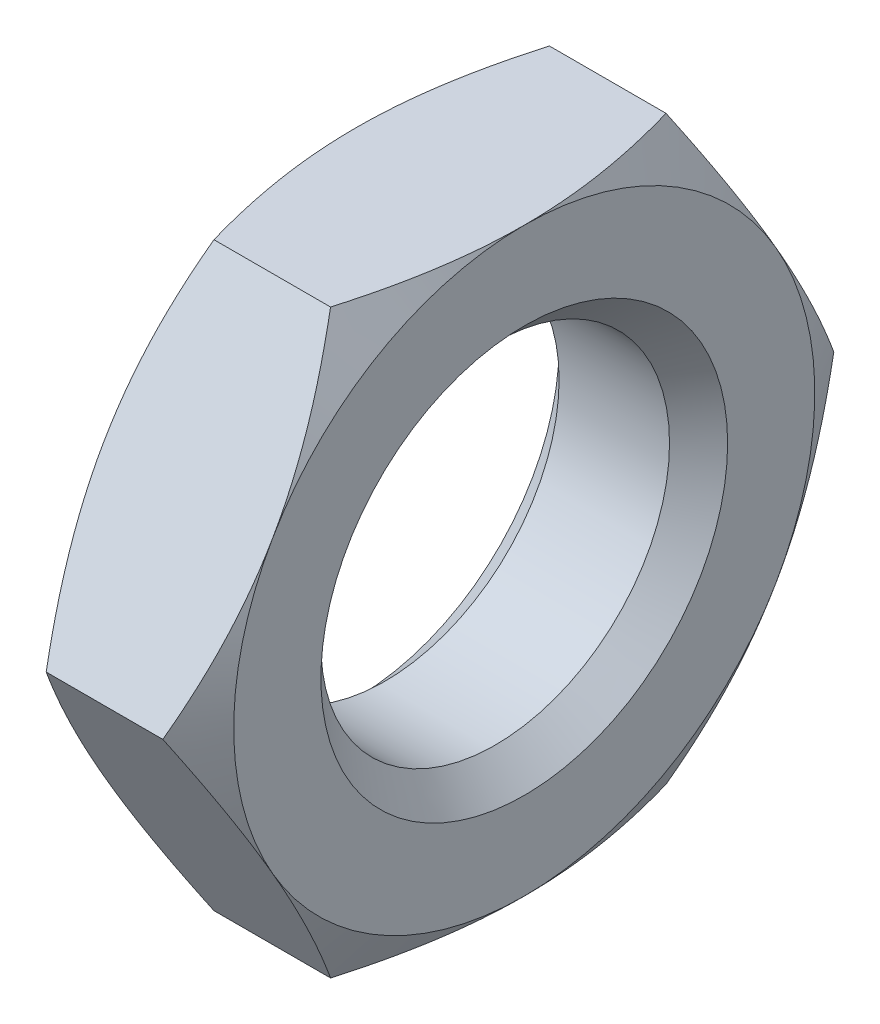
ISO-10303-21;
HEADER;
FILE_DESCRIPTION(('STEP AP214'),'2;1');
FILE_NAME('part.step','',(''),(''),'','','');
FILE_SCHEMA(('AUTOMOTIVE_DESIGN { 1 0 10303 214 1 1 1 1 }'));
ENDSEC;
DATA;
#1=APPLICATION_CONTEXT('core data for automotive mechanical design processes');
#2=APPLICATION_PROTOCOL_DEFINITION('international standard','automotive_design',2000,#1);
#3=PRODUCT_CONTEXT('',#1,'mechanical');
#4=PRODUCT('Part','Part','',(#3));
#5=PRODUCT_RELATED_PRODUCT_CATEGORY('part','',(#4));
#6=PRODUCT_DEFINITION_FORMATION('','',#4);
#7=PRODUCT_DEFINITION_CONTEXT('part definition',#1,'design');
#8=PRODUCT_DEFINITION('design','',#6,#7);
#9=PRODUCT_DEFINITION_SHAPE('','',#8);
#10=(LENGTH_UNIT() NAMED_UNIT(*) SI_UNIT(.MILLI.,.METRE.));
#11=(NAMED_UNIT(*) PLANE_ANGLE_UNIT() SI_UNIT($,.RADIAN.));
#12=(NAMED_UNIT(*) SI_UNIT($,.STERADIAN.) SOLID_ANGLE_UNIT());
#13=UNCERTAINTY_MEASURE_WITH_UNIT(LENGTH_MEASURE(1.E-05),#10,'distance_accuracy_value','');
#14=(GEOMETRIC_REPRESENTATION_CONTEXT(3) GLOBAL_UNCERTAINTY_ASSIGNED_CONTEXT((#13)) GLOBAL_UNIT_ASSIGNED_CONTEXT((#10,
#11,#12)) REPRESENTATION_CONTEXT('',''));
#15=CARTESIAN_POINT('',(0.,0.,0.));
#16=DIRECTION('',(0.,0.,1.));
#17=DIRECTION('',(1.,0.,0.));
#18=AXIS2_PLACEMENT_3D('',#15,#16,#17);
#19=CARTESIAN_POINT('',(2.9,5.,-2.88675134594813));
#20=DIRECTION('',(1.,0.,0.));
#21=DIRECTION('',(0.,0.,-1.));
#22=AXIS2_PLACEMENT_3D('',#19,#20,#21);
#23=PLANE('',#22);
#24=CARTESIAN_POINT('',(2.9,0.,0.));
#25=DIRECTION('',(1.,0.,0.));
#26=DIRECTION('',(0.,0.,-1.));
#27=AXIS2_PLACEMENT_3D('',#24,#25,#26);
#28=CIRCLE('',#27,3.5);
#29=CARTESIAN_POINT('',(2.9,0.,-3.5));
#30=VERTEX_POINT('',#29);
#31=EDGE_CURVE('E11',#30,#30,#28,.F.);
#32=ORIENTED_EDGE('',*,*,#31,.T.);
#33=EDGE_LOOP('',(#32));
#34=FACE_BOUND('',#33,.T.);
#35=CARTESIAN_POINT('',(2.9,0.,0.));
#36=DIRECTION('',(1.,0.,0.));
#37=DIRECTION('',(0.,0.,-1.));
#38=AXIS2_PLACEMENT_3D('',#35,#36,#37);
#39=CIRCLE('',#38,5.);
#40=CARTESIAN_POINT('',(2.9,-5.,0.));
#41=VERTEX_POINT('',#40);
#42=CARTESIAN_POINT('',(2.9,-2.5,-4.33012701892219));
#43=VERTEX_POINT('',#42);
#44=EDGE_CURVE('E142',#41,#43,#39,.T.);
#45=ORIENTED_EDGE('',*,*,#44,.T.);
#46=CARTESIAN_POINT('',(2.9,2.5,-4.33012701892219));
#47=VERTEX_POINT('',#46);
#48=EDGE_CURVE('E130',#43,#47,#39,.T.);
#49=ORIENTED_EDGE('',*,*,#48,.T.);
#50=CARTESIAN_POINT('',(2.9,5.,0.));
#51=VERTEX_POINT('',#50);
#52=EDGE_CURVE('E144',#47,#51,#39,.T.);
#53=ORIENTED_EDGE('',*,*,#52,.T.);
#54=CARTESIAN_POINT('',(2.9,2.5,4.33012701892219));
#55=VERTEX_POINT('',#54);
#56=EDGE_CURVE('E55',#51,#55,#39,.T.);
#57=ORIENTED_EDGE('',*,*,#56,.T.);
#58=CARTESIAN_POINT('',(2.9,-2.5,4.33012701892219));
#59=VERTEX_POINT('',#58);
#60=EDGE_CURVE('E63',#55,#59,#39,.T.);
#61=ORIENTED_EDGE('',*,*,#60,.T.);
#62=EDGE_CURVE('E166',#59,#41,#39,.T.);
#63=ORIENTED_EDGE('',*,*,#62,.T.);
#64=EDGE_LOOP('',(#45,#49,#53,#57,#61,#63));
#65=FACE_BOUND('',#64,.T.);
#66=ADVANCED_FACE('F39',(#34,#65),#23,.T.);
#67=CARTESIAN_POINT('',(0.,5.,-2.88675134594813));
#68=DIRECTION('',(1.,0.,0.));
#69=DIRECTION('',(0.,0.,-1.));
#70=AXIS2_PLACEMENT_3D('',#67,#68,#69);
#71=PLANE('',#70);
#72=CARTESIAN_POINT('',(0.,0.,0.));
#73=DIRECTION('',(1.,0.,0.));
#74=DIRECTION('',(0.,0.,-1.));
#75=AXIS2_PLACEMENT_3D('',#72,#73,#74);
#76=CIRCLE('',#75,3.5);
#77=CARTESIAN_POINT('',(0.,0.,-3.5));
#78=VERTEX_POINT('',#77);
#79=EDGE_CURVE('E164',#78,#78,#76,.T.);
#80=ORIENTED_EDGE('',*,*,#79,.T.);
#81=EDGE_LOOP('',(#80));
#82=FACE_BOUND('',#81,.T.);
#83=CARTESIAN_POINT('',(0.,0.,0.));
#84=DIRECTION('',(1.,0.,0.));
#85=DIRECTION('',(0.,0.,-1.));
#86=AXIS2_PLACEMENT_3D('',#83,#84,#85);
#87=CIRCLE('',#86,5.);
#88=CARTESIAN_POINT('',(0.,-2.5,-4.33012701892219));
#89=VERTEX_POINT('',#88);
#90=CARTESIAN_POINT('',(0.,2.5,-4.33012701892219));
#91=VERTEX_POINT('',#90);
#92=EDGE_CURVE('E173',#89,#91,#87,.T.);
#93=ORIENTED_EDGE('',*,*,#92,.F.);
#94=CARTESIAN_POINT('',(0.,-5.,0.));
#95=VERTEX_POINT('',#94);
#96=EDGE_CURVE('E317',#95,#89,#87,.T.);
#97=ORIENTED_EDGE('',*,*,#96,.F.);
#98=CARTESIAN_POINT('',(0.,-2.5,4.33012701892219));
#99=VERTEX_POINT('',#98);
#100=EDGE_CURVE('E320',#99,#95,#87,.T.);
#101=ORIENTED_EDGE('',*,*,#100,.F.);
#102=CARTESIAN_POINT('',(0.,2.5,4.33012701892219));
#103=VERTEX_POINT('',#102);
#104=EDGE_CURVE('E326',#103,#99,#87,.T.);
#105=ORIENTED_EDGE('',*,*,#104,.F.);
#106=CARTESIAN_POINT('',(0.,5.,0.));
#107=VERTEX_POINT('',#106);
#108=EDGE_CURVE('E178',#107,#103,#87,.T.);
#109=ORIENTED_EDGE('',*,*,#108,.F.);
#110=EDGE_CURVE('E174',#91,#107,#87,.T.);
#111=ORIENTED_EDGE('',*,*,#110,.F.);
#112=EDGE_LOOP('',(#93,#97,#101,#105,#109,#111));
#113=FACE_BOUND('',#112,.T.);
#114=ADVANCED_FACE('F318',(#82,#113),#71,.F.);
#115=CARTESIAN_POINT('',(2.9,0.,0.));
#116=DIRECTION('',(-1.,0.,0.));
#117=DIRECTION('',(0.,0.,1.));
#118=AXIS2_PLACEMENT_3D('',#115,#116,#117);
#119=CYLINDRICAL_SURFACE('',#118,3.);
#120=CARTESIAN_POINT('',(0.500000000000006,0.,0.));
#121=DIRECTION('',(1.,0.,0.));
#122=DIRECTION('',(0.,0.,-1.));
#123=AXIS2_PLACEMENT_3D('',#120,#121,#122);
#124=CIRCLE('',#123,3.);
#125=CARTESIAN_POINT('',(0.500000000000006,0.,-3.));
#126=VERTEX_POINT('',#125);
#127=EDGE_CURVE('E48',#126,#126,#124,.F.);
#128=ORIENTED_EDGE('',*,*,#127,.T.);
#129=EDGE_LOOP('',(#128));
#130=FACE_BOUND('',#129,.T.);
#131=CARTESIAN_POINT('',(2.4,0.,0.));
#132=DIRECTION('',(1.,0.,0.));
#133=DIRECTION('',(0.,0.,-1.));
#134=AXIS2_PLACEMENT_3D('',#131,#132,#133);
#135=CIRCLE('',#134,3.);
#136=CARTESIAN_POINT('',(2.4,0.,-3.));
#137=VERTEX_POINT('',#136);
#138=EDGE_CURVE('E386',#137,#137,#135,.T.);
#139=ORIENTED_EDGE('',*,*,#138,.T.);
#140=EDGE_LOOP('',(#139));
#141=FACE_BOUND('',#140,.T.);
#142=ADVANCED_FACE('F234',(#130,#141),#119,.F.);
#143=CARTESIAN_POINT('',(0.,0.,0.));
#144=DIRECTION('',(1.,0.,0.));
#145=DIRECTION('',(0.,0.,-1.));
#146=AXIS2_PLACEMENT_3D('',#143,#144,#145);
#147=CONICAL_SURFACE('',#146,5.,1.0471975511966);
#148=CARTESIAN_POINT('',(0.446648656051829,-5.0002,-2.88663587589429));
#149=CARTESIAN_POINT('',(0.373386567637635,-4.78046540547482,-3.01349970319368));
#150=CARTESIAN_POINT('',(0.306751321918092,-4.55885141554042,-3.14144859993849));
#151=CARTESIAN_POINT('',(0.190438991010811,-4.11178600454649,-3.39956193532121));
#152=CARTESIAN_POINT('',(0.140803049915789,-3.88632664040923,-3.52973095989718));
#153=CARTESIAN_POINT('',(0.0635510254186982,-3.43816769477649,-3.78847564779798));
#154=CARTESIAN_POINT('',(0.0354203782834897,-3.21553790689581,-3.91701101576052));
#155=CARTESIAN_POINT('',(0.0101949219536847,-2.88081009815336,-4.11026620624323));
#156=CARTESIAN_POINT('',(0.00461345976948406,-2.76915780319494,-4.17472868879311));
#157=CARTESIAN_POINT('',(-0.000797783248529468,-2.5457500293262,-4.30371322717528));
#158=CARTESIAN_POINT('',(-0.00062774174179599,-2.43399455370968,-4.36823528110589));
#159=CARTESIAN_POINT('',(0.0077536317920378,-2.12781576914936,-4.54500768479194));
#160=CARTESIAN_POINT('',(0.021829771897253,-1.93349391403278,-4.65719946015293));
#161=CARTESIAN_POINT('',(0.0664652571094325,-1.54613989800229,-4.88083840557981));
#162=CARTESIAN_POINT('',(0.0970398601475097,-1.35310909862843,-4.9922847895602));
#163=CARTESIAN_POINT('',(0.173468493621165,-0.964974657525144,-5.21637431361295));
#164=CARTESIAN_POINT('',(0.219646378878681,-0.769920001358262,-5.32898917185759));
#165=CARTESIAN_POINT('',(0.324451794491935,-0.38271965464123,-5.55253939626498));
#166=CARTESIAN_POINT('',(0.383054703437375,-0.190569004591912,-5.66347762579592));
#167=CARTESIAN_POINT('',(0.44664865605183,0.000200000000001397,-5.7736181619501));
#168=B_SPLINE_CURVE_WITH_KNOTS('',3,(#148,#149,#150,#151,#152,#153,#154,#155,#156,#157,#158,
#159,#160,#161,#162,#163,#164,#165,#166,#167),.UNSPECIFIED.,.F.,.F.,(4,2,2,2,2,2,2,2,2,4),(0.,
0.79255584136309,1.58701660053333,2.36181537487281,2.74884076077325,3.13585419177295,
3.80962362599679,4.48401723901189,5.17336882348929,5.86136694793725),.UNSPECIFIED.);
#169=CARTESIAN_POINT('',(0.446581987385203,0.,-5.77350269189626));
#170=VERTEX_POINT('',#169);
#171=EDGE_CURVE('E333',#89,#170,#168,.T.);
#172=ORIENTED_EDGE('',*,*,#171,.F.);
#173=ORIENTED_EDGE('',*,*,#92,.T.);
#174=CARTESIAN_POINT('',(0.44664865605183,-0.000199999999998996,-5.7736181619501));
#175=CARTESIAN_POINT('',(0.373386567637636,0.219534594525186,-5.64675433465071));
#176=CARTESIAN_POINT('',(0.306751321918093,0.441148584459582,-5.5188054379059));
#177=CARTESIAN_POINT('',(0.190438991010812,0.888213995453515,-5.26069210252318));
#178=CARTESIAN_POINT('',(0.14080304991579,1.11367335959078,-5.13052307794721));
#179=CARTESIAN_POINT('',(0.0635510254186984,1.56183230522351,-4.87177839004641));
#180=CARTESIAN_POINT('',(0.0354203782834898,1.78446209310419,-4.74324302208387));
#181=CARTESIAN_POINT('',(0.010194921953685,2.11918990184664,-4.54998783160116));
#182=CARTESIAN_POINT('',(0.00461345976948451,2.23084219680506,-4.48552534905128));
#183=CARTESIAN_POINT('',(-0.000797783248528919,2.4542499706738,-4.35654081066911));
#184=CARTESIAN_POINT('',(-0.000627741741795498,2.56600544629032,-4.2920187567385));
#185=CARTESIAN_POINT('',(0.00775363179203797,2.87218423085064,-4.11524635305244));
#186=CARTESIAN_POINT('',(0.0218297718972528,3.06650608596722,-4.00305457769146));
#187=CARTESIAN_POINT('',(0.0664652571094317,3.45386010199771,-3.77941563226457));
#188=CARTESIAN_POINT('',(0.0970398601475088,3.64689090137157,-3.66796924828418));
#189=CARTESIAN_POINT('',(0.173468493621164,4.03502534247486,-3.44387972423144));
#190=CARTESIAN_POINT('',(0.219646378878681,4.23007999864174,-3.3312648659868));
#191=CARTESIAN_POINT('',(0.324451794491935,4.61728034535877,-3.1077146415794));
#192=CARTESIAN_POINT('',(0.383054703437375,4.80943099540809,-2.99677641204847));
#193=CARTESIAN_POINT('',(0.446648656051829,5.0002,-2.88663587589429));
#194=B_SPLINE_CURVE_WITH_KNOTS('',3,(#174,#175,#176,#177,#178,#179,#180,#181,#182,#183,#184,
#185,#186,#187,#188,#189,#190,#191,#192,#193),.UNSPECIFIED.,.F.,.F.,(4,2,2,2,2,2,2,2,2,4),(0.,
0.792555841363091,1.58701660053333,2.36181537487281,2.74884076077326,3.13585419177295,
3.80962362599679,4.48401723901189,5.17336882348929,5.86136694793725),.UNSPECIFIED.);
#195=EDGE_CURVE('E215',#170,#91,#194,.T.);
#196=ORIENTED_EDGE('',*,*,#195,.F.);
#197=EDGE_LOOP('',(#172,#173,#196));
#198=FACE_BOUND('',#197,.T.);
#199=ADVANCED_FACE('F194',(#198),#147,.T.);
#200=ORIENTED_EDGE('',*,*,#96,.T.);
#201=CARTESIAN_POINT('',(0.446581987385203,-5.,-2.88675134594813));
#202=VERTEX_POINT('',#201);
#203=EDGE_CURVE('E156',#202,#89,#168,.T.);
#204=ORIENTED_EDGE('',*,*,#203,.F.);
#205=CARTESIAN_POINT('',(2.46051779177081,-5.,-7.79614402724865));
#206=CARTESIAN_POINT('',(2.35424449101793,-5.,-7.57741083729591));
#207=CARTESIAN_POINT('',(2.24897808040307,-5.,-7.35818002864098));
#208=CARTESIAN_POINT('',(2.04102447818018,-5.,-6.91845871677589));
#209=CARTESIAN_POINT('',(1.93833768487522,-5.,-6.69796802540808));
#210=CARTESIAN_POINT('',(1.73560106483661,-5.,-6.25434641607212));
#211=CARTESIAN_POINT('',(1.63556827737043,-5.,-6.0312076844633));
#212=CARTESIAN_POINT('',(1.43954045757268,-5.,-5.58317015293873));
#213=CARTESIAN_POINT('',(1.34354523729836,-5.,-5.35827143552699));
#214=CARTESIAN_POINT('',(1.15358419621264,-5.,-4.89892580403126));
#215=CARTESIAN_POINT('',(1.0597887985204,-5.,-4.66440802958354));
#216=CARTESIAN_POINT('',(0.879195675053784,-5.,-4.19264423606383));
#217=CARTESIAN_POINT('',(0.792398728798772,-5.,-3.95539791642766));
#218=CARTESIAN_POINT('',(0.628050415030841,-5.,-3.47823034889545));
#219=CARTESIAN_POINT('',(0.55048068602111,-5.,-3.23831548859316));
#220=CARTESIAN_POINT('',(0.407048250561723,-5.,-2.75504420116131));
#221=CARTESIAN_POINT('',(0.341181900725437,-5.,-2.51168887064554));
#222=CARTESIAN_POINT('',(0.2246440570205,-5.,-2.02276429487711));
#223=CARTESIAN_POINT('',(0.173888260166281,-5.,-1.77721551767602));
#224=CARTESIAN_POINT('',(0.090407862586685,-5.,-1.28302035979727));
#225=CARTESIAN_POINT('',(0.0576814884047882,-5.,-1.03437428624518));
#226=CARTESIAN_POINT('',(0.0132973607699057,-5.,-0.538491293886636));
#227=CARTESIAN_POINT('',(0.00136553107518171,-5.,-0.291279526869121));
#228=CARTESIAN_POINT('',(-0.00114195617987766,-5.,0.203273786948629));
#229=CARTESIAN_POINT('',(0.00828268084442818,-5.,0.45061533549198));
#230=CARTESIAN_POINT('',(0.0416407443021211,-5.,0.869294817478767));
#231=CARTESIAN_POINT('',(0.0603462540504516,-5.,1.04107553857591));
#232=CARTESIAN_POINT('',(0.106916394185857,-5.,1.38339934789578));
#233=CARTESIAN_POINT('',(0.134782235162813,-5.,1.55394226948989));
#234=CARTESIAN_POINT('',(0.230657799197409,-5.,2.06347685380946));
#235=CARTESIAN_POINT('',(0.310928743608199,-5.,2.40018821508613));
#236=CARTESIAN_POINT('',(0.450370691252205,-5.,2.90370614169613));
#237=CARTESIAN_POINT('',(0.500677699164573,-5.,3.07311638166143));
#238=CARTESIAN_POINT('',(0.606579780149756,-5.,3.410291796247));
#239=CARTESIAN_POINT('',(0.66217488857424,-5.,3.57805695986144));
#240=CARTESIAN_POINT('',(0.777755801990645,-5.,3.9119940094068));
#241=CARTESIAN_POINT('',(0.837740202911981,-5.,4.07816638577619));
#242=CARTESIAN_POINT('',(0.961387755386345,-5.,4.40913029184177));
#243=CARTESIAN_POINT('',(1.02505086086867,-5.,4.57392183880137));
#244=CARTESIAN_POINT('',(1.18111106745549,-5.,4.96690449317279));
#245=CARTESIAN_POINT('',(1.2749551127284,-5.,5.19451998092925));
#246=CARTESIAN_POINT('',(1.46731807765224,-5.,5.64777297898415));
#247=CARTESIAN_POINT('',(1.56583730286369,-5.,5.87341035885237));
#248=CARTESIAN_POINT('',(1.76659783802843,-5.,6.32307730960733));
#249=CARTESIAN_POINT('',(1.86883995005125,-5.,6.54710652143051));
#250=CARTESIAN_POINT('',(2.07629576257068,-5.,6.99378699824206));
#251=CARTESIAN_POINT('',(2.18150953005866,-5.,7.21643823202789));
#252=CARTESIAN_POINT('',(2.50096693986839,-5.,7.88317353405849));
#253=CARTESIAN_POINT('',(2.71879919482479,-5.,8.32553697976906));
#254=CARTESIAN_POINT('',(3.16086005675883,-5.,9.20696283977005));
#255=CARTESIAN_POINT('',(3.38508783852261,-5.,9.64602567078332));
#256=CARTESIAN_POINT('',(3.81866217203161,-5.,10.4842389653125));
#257=CARTESIAN_POINT('',(4.0276355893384,-5.,10.8835827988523));
#258=CARTESIAN_POINT('',(4.44843062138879,-5.,11.6807838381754));
#259=CARTESIAN_POINT('',(4.66025234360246,-5.,12.0786409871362));
#260=CARTESIAN_POINT('',(5.08550734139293,-5.,12.8721608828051));
#261=CARTESIAN_POINT('',(5.29893499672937,-5.,13.2678266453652));
#262=CARTESIAN_POINT('',(5.72748561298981,-5.,14.0582098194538));
#263=CARTESIAN_POINT('',(5.94260847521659,-5.,14.4529272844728));
#264=CARTESIAN_POINT('',(6.15836210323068,-5.,14.8472971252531));
#265=B_SPLINE_CURVE_WITH_KNOTS('',3,(#205,#206,#207,#208,#209,#210,#211,#212,#213,#214,#215,
#216,#217,#218,#219,#220,#221,#222,#223,#224,#225,#226,#227,#228,#229,#230,#231,#232,#233,#234,
#235,#236,#237,#238,#239,#240,#241,#242,#243,#244,#245,#246,#247,#248,#249,#250,#251,#252,#253,
#254,#255,#256,#257,#258,#259,#260,#261,#262,#263,#264),.UNSPECIFIED.,.F.,.F.,(4,2,2,2,2,2,2,2,
2,2,2,2,2,2,2,2,2,2,2,2,2,2,2,2,2,2,2,2,2,4),(0.,0.729559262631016,1.45923048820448,
2.19280395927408,2.92634324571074,3.68399396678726,4.4417289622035,5.19792995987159,
5.95389513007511,6.70556007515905,7.45715106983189,8.19875883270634,8.9403768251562,
9.45851468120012,9.97672103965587,11.0136918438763,11.5438116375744,12.0739349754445,
12.6038894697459,13.1338373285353,13.8723728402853,14.6109566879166,15.349700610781,
16.0884612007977,17.5676360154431,19.0466208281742,20.39875515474,21.7509406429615,
23.0996113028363,24.4482040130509),.UNSPECIFIED.);
#266=EDGE_CURVE('E177',#95,#202,#265,.F.);
#267=ORIENTED_EDGE('',*,*,#266,.F.);
#268=EDGE_LOOP('',(#200,#204,#267));
#269=FACE_BOUND('',#268,.T.);
#270=ADVANCED_FACE('F351',(#269),#147,.T.);
#271=CARTESIAN_POINT('',(1.45,0.,0.));
#272=DIRECTION('',(-1.,0.,0.));
#273=DIRECTION('',(0.,0.,1.));
#274=AXIS2_PLACEMENT_3D('',#271,#272,#273);
#275=CONICAL_SURFACE('',#274,7.51147367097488,1.0471975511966);
#276=CARTESIAN_POINT('',(2.45335134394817,0.000200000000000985,-5.7736181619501));
#277=CARTESIAN_POINT('',(2.52661343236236,-0.219534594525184,-5.64675433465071));
#278=CARTESIAN_POINT('',(2.59324867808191,-0.44114858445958,-5.5188054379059));
#279=CARTESIAN_POINT('',(2.70956100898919,-0.888213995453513,-5.26069210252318));
#280=CARTESIAN_POINT('',(2.75919695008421,-1.11367335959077,-5.13052307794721));
#281=CARTESIAN_POINT('',(2.8364489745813,-1.56183230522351,-4.87177839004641));
#282=CARTESIAN_POINT('',(2.86457962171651,-1.78446209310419,-4.74324302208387));
#283=CARTESIAN_POINT('',(2.88980507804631,-2.11918990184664,-4.54998783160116));
#284=CARTESIAN_POINT('',(2.89538654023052,-2.23084219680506,-4.48552534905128));
#285=CARTESIAN_POINT('',(2.90079778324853,-2.4542499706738,-4.35654081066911));
#286=CARTESIAN_POINT('',(2.9006277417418,-2.56600544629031,-4.2920187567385));
#287=CARTESIAN_POINT('',(2.89224636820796,-2.87218423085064,-4.11524635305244));
#288=CARTESIAN_POINT('',(2.87817022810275,-3.06650608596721,-4.00305457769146));
#289=CARTESIAN_POINT('',(2.83353474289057,-3.45386010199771,-3.77941563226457));
#290=CARTESIAN_POINT('',(2.80296013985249,-3.64689090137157,-3.66796924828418));
#291=CARTESIAN_POINT('',(2.72653150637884,-4.03502534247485,-3.44387972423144));
#292=CARTESIAN_POINT('',(2.68035362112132,-4.23007999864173,-3.3312648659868));
#293=CARTESIAN_POINT('',(2.57554820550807,-4.61728034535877,-3.1077146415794));
#294=CARTESIAN_POINT('',(2.51694529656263,-4.80943099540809,-2.99677641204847));
#295=CARTESIAN_POINT('',(2.45335134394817,-5.0002,-2.88663587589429));
#296=B_SPLINE_CURVE_WITH_KNOTS('',3,(#276,#277,#278,#279,#280,#281,#282,#283,#284,#285,#286,
#287,#288,#289,#290,#291,#292,#293,#294,#295),.UNSPECIFIED.,.F.,.F.,(4,2,2,2,2,2,2,2,2,4),(0.,
0.792555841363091,1.58701660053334,2.36181537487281,2.74884076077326,3.13585419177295,
3.80962362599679,4.48401723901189,5.17336882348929,5.86136694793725),.UNSPECIFIED.);
#297=CARTESIAN_POINT('',(2.4534180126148,-5.,-2.88675134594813));
#298=VERTEX_POINT('',#297);
#299=EDGE_CURVE('E147',#43,#298,#296,.T.);
#300=ORIENTED_EDGE('',*,*,#299,.F.);
#301=ORIENTED_EDGE('',*,*,#44,.F.);
#302=CARTESIAN_POINT('',(0.439482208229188,-5.,-7.79614402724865));
#303=CARTESIAN_POINT('',(0.545755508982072,-5.,-7.57741083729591));
#304=CARTESIAN_POINT('',(0.651021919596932,-5.,-7.35818002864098));
#305=CARTESIAN_POINT('',(0.85897552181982,-5.,-6.91845871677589));
#306=CARTESIAN_POINT('',(0.961662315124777,-5.,-6.69796802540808));
#307=CARTESIAN_POINT('',(1.16439893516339,-5.,-6.25434641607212));
#308=CARTESIAN_POINT('',(1.26443172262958,-5.,-6.0312076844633));
#309=CARTESIAN_POINT('',(1.46045954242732,-5.,-5.58317015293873));
#310=CARTESIAN_POINT('',(1.55645476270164,-5.,-5.35827143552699));
#311=CARTESIAN_POINT('',(1.74641580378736,-5.,-4.89892580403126));
#312=CARTESIAN_POINT('',(1.8402112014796,-5.,-4.66440802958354));
#313=CARTESIAN_POINT('',(2.02080432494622,-5.,-4.19264423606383));
#314=CARTESIAN_POINT('',(2.10760127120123,-5.,-3.95539791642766));
#315=CARTESIAN_POINT('',(2.27194958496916,-5.,-3.47823034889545));
#316=CARTESIAN_POINT('',(2.34951931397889,-5.,-3.23831548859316));
#317=CARTESIAN_POINT('',(2.49295174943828,-5.,-2.75504420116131));
#318=CARTESIAN_POINT('',(2.55881809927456,-5.,-2.51168887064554));
#319=CARTESIAN_POINT('',(2.6753559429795,-5.,-2.02276429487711));
#320=CARTESIAN_POINT('',(2.72611173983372,-5.,-1.77721551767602));
#321=CARTESIAN_POINT('',(2.80959213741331,-5.,-1.28302035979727));
#322=CARTESIAN_POINT('',(2.84231851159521,-5.,-1.03437428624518));
#323=CARTESIAN_POINT('',(2.88670263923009,-5.,-0.538491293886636));
#324=CARTESIAN_POINT('',(2.89863446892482,-5.,-0.291279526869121));
#325=CARTESIAN_POINT('',(2.90114195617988,-5.,0.203273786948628));
#326=CARTESIAN_POINT('',(2.89171731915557,-5.,0.45061533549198));
#327=CARTESIAN_POINT('',(2.85835925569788,-5.,0.869294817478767));
#328=CARTESIAN_POINT('',(2.83965374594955,-5.,1.04107553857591));
#329=CARTESIAN_POINT('',(2.79308360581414,-5.,1.38339934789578));
#330=CARTESIAN_POINT('',(2.76521776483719,-5.,1.55394226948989));
#331=CARTESIAN_POINT('',(2.66934220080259,-5.,2.06347685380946));
#332=CARTESIAN_POINT('',(2.5890712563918,-5.,2.40018821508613));
#333=CARTESIAN_POINT('',(2.44962930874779,-5.,2.90370614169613));
#334=CARTESIAN_POINT('',(2.39932230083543,-5.,3.07311638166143));
#335=CARTESIAN_POINT('',(2.29342021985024,-5.,3.410291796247));
#336=CARTESIAN_POINT('',(2.23782511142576,-5.,3.57805695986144));
#337=CARTESIAN_POINT('',(2.12224419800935,-5.,3.9119940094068));
#338=CARTESIAN_POINT('',(2.06225979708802,-5.,4.07816638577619));
#339=CARTESIAN_POINT('',(1.93861224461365,-5.,4.40913029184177));
#340=CARTESIAN_POINT('',(1.87494913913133,-5.,4.57392183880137));
#341=CARTESIAN_POINT('',(1.71888893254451,-5.,4.96690449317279));
#342=CARTESIAN_POINT('',(1.6250448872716,-5.,5.19451998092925));
#343=CARTESIAN_POINT('',(1.43268192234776,-5.,5.64777297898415));
#344=CARTESIAN_POINT('',(1.33416269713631,-5.,5.87341035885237));
#345=CARTESIAN_POINT('',(1.13340216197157,-5.,6.32307730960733));
#346=CARTESIAN_POINT('',(1.03116004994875,-5.,6.54710652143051));
#347=CARTESIAN_POINT('',(0.82370423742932,-5.,6.99378699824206));
#348=CARTESIAN_POINT('',(0.718490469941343,-5.,7.21643823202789));
#349=CARTESIAN_POINT('',(0.399033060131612,-5.,7.88317353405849));
#350=CARTESIAN_POINT('',(0.18120080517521,-5.,8.32553697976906));
#351=CARTESIAN_POINT('',(-0.260860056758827,-5.,9.20696283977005));
#352=CARTESIAN_POINT('',(-0.485087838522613,-5.,9.64602567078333));
#353=CARTESIAN_POINT('',(-0.918662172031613,-5.,10.4842389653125));
#354=CARTESIAN_POINT('',(-1.1276355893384,-5.,10.8835827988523));
#355=CARTESIAN_POINT('',(-1.54843062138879,-5.,11.6807838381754));
#356=CARTESIAN_POINT('',(-1.76025234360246,-5.,12.0786409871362));
#357=CARTESIAN_POINT('',(-2.18550734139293,-5.,12.8721608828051));
#358=CARTESIAN_POINT('',(-2.39893499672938,-5.,13.2678266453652));
#359=CARTESIAN_POINT('',(-2.82748561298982,-5.,14.0582098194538));
#360=CARTESIAN_POINT('',(-3.04260847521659,-5.,14.4529272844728));
#361=CARTESIAN_POINT('',(-3.25836210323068,-5.,14.8472971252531));
#362=B_SPLINE_CURVE_WITH_KNOTS('',3,(#302,#303,#304,#305,#306,#307,#308,#309,#310,#311,#312,
#313,#314,#315,#316,#317,#318,#319,#320,#321,#322,#323,#324,#325,#326,#327,#328,#329,#330,#331,
#332,#333,#334,#335,#336,#337,#338,#339,#340,#341,#342,#343,#344,#345,#346,#347,#348,#349,#350,
#351,#352,#353,#354,#355,#356,#357,#358,#359,#360,#361),.UNSPECIFIED.,.F.,.F.,(4,2,2,2,2,2,2,2,
2,2,2,2,2,2,2,2,2,2,2,2,2,2,2,2,2,2,2,2,2,4),(0.,0.729559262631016,1.45923048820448,
2.19280395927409,2.92634324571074,3.68399396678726,4.4417289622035,5.19792995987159,
5.95389513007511,6.70556007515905,7.45715106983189,8.19875883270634,8.9403768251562,
9.45851468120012,9.97672103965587,11.0136918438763,11.5438116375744,12.0739349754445,
12.6038894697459,13.1338373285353,13.8723728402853,14.6109566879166,15.349700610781,
16.0884612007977,17.5676360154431,19.0466208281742,20.39875515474,21.7509406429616,
23.0996113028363,24.4482040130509),.UNSPECIFIED.);
#363=EDGE_CURVE('E151',#298,#41,#362,.T.);
#364=ORIENTED_EDGE('',*,*,#363,.F.);
#365=EDGE_LOOP('',(#300,#301,#364));
#366=FACE_BOUND('',#365,.T.);
#367=ADVANCED_FACE('F148',(#366),#275,.T.);
#368=ORIENTED_EDGE('',*,*,#48,.F.);
#369=CARTESIAN_POINT('',(2.4534180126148,0.,-5.77350269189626));
#370=VERTEX_POINT('',#369);
#371=EDGE_CURVE('E134',#370,#43,#296,.T.);
#372=ORIENTED_EDGE('',*,*,#371,.F.);
#373=CARTESIAN_POINT('',(2.45335134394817,5.0002,-2.88663587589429));
#374=CARTESIAN_POINT('',(2.52661343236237,4.78046540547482,-3.01349970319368));
#375=CARTESIAN_POINT('',(2.59324867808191,4.55885141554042,-3.14144859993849));
#376=CARTESIAN_POINT('',(2.70956100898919,4.11178600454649,-3.39956193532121));
#377=CARTESIAN_POINT('',(2.75919695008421,3.88632664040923,-3.52973095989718));
#378=CARTESIAN_POINT('',(2.8364489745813,3.43816769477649,-3.78847564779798));
#379=CARTESIAN_POINT('',(2.86457962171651,3.21553790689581,-3.91701101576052));
#380=CARTESIAN_POINT('',(2.88980507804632,2.88081009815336,-4.11026620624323));
#381=CARTESIAN_POINT('',(2.89538654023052,2.76915780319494,-4.17472868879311));
#382=CARTESIAN_POINT('',(2.90079778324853,2.5457500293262,-4.30371322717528));
#383=CARTESIAN_POINT('',(2.9006277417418,2.43399455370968,-4.36823528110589));
#384=CARTESIAN_POINT('',(2.89224636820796,2.12781576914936,-4.54500768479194));
#385=CARTESIAN_POINT('',(2.87817022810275,1.93349391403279,-4.65719946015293));
#386=CARTESIAN_POINT('',(2.83353474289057,1.54613989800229,-4.88083840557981));
#387=CARTESIAN_POINT('',(2.80296013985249,1.35310909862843,-4.9922847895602));
#388=CARTESIAN_POINT('',(2.72653150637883,0.964974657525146,-5.21637431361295));
#389=CARTESIAN_POINT('',(2.68035362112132,0.769920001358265,-5.32898917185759));
#390=CARTESIAN_POINT('',(2.57554820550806,0.382719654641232,-5.55253939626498));
#391=CARTESIAN_POINT('',(2.51694529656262,0.190569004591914,-5.66347762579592));
#392=CARTESIAN_POINT('',(2.45335134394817,-0.000199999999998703,-5.7736181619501));
#393=B_SPLINE_CURVE_WITH_KNOTS('',3,(#373,#374,#375,#376,#377,#378,#379,#380,#381,#382,#383,
#384,#385,#386,#387,#388,#389,#390,#391,#392),.UNSPECIFIED.,.F.,.F.,(4,2,2,2,2,2,2,2,2,4),(0.,
0.79255584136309,1.58701660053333,2.36181537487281,2.74884076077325,3.13585419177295,
3.80962362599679,4.48401723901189,5.17336882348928,5.86136694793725),.UNSPECIFIED.);
#394=EDGE_CURVE('E136',#47,#370,#393,.T.);
#395=ORIENTED_EDGE('',*,*,#394,.F.);
#396=EDGE_LOOP('',(#368,#372,#395));
#397=FACE_BOUND('',#396,.T.);
#398=ADVANCED_FACE('F132',(#397),#275,.T.);
#399=ORIENTED_EDGE('',*,*,#100,.T.);
#400=CARTESIAN_POINT('',(0.446581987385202,-5.,2.88675134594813));
#401=VERTEX_POINT('',#400);
#402=EDGE_CURVE('E187',#401,#95,#265,.F.);
#403=ORIENTED_EDGE('',*,*,#402,.F.);
#404=CARTESIAN_POINT('',(0.446648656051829,0.000200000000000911,5.7736181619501));
#405=CARTESIAN_POINT('',(0.373386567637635,-0.219534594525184,5.64675433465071));
#406=CARTESIAN_POINT('',(0.306751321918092,-0.44114858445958,5.5188054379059));
#407=CARTESIAN_POINT('',(0.190438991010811,-0.888213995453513,5.26069210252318));
#408=CARTESIAN_POINT('',(0.140803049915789,-1.11367335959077,5.13052307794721));
#409=CARTESIAN_POINT('',(0.0635510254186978,-1.56183230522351,4.87177839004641));
#410=CARTESIAN_POINT('',(0.0354203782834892,-1.78446209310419,4.74324302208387));
#411=CARTESIAN_POINT('',(0.010194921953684,-2.11918990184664,4.54998783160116));
#412=CARTESIAN_POINT('',(0.00461345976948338,-2.23084219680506,4.48552534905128));
#413=CARTESIAN_POINT('',(-0.00079778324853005,-2.4542499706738,4.35654081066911));
#414=CARTESIAN_POINT('',(-0.000627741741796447,-2.56600544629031,4.2920187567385));
#415=CARTESIAN_POINT('',(0.00775363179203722,-2.87218423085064,4.11524635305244));
#416=CARTESIAN_POINT('',(0.0218297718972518,-3.06650608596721,4.00305457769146));
#417=CARTESIAN_POINT('',(0.0664652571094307,-3.45386010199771,3.77941563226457));
#418=CARTESIAN_POINT('',(0.097039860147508,-3.64689090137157,3.66796924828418));
#419=CARTESIAN_POINT('',(0.173468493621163,-4.03502534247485,3.44387972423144));
#420=CARTESIAN_POINT('',(0.21964637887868,-4.23007999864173,3.3312648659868));
#421=CARTESIAN_POINT('',(0.324451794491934,-4.61728034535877,3.1077146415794));
#422=CARTESIAN_POINT('',(0.383054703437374,-4.80943099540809,2.99677641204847));
#423=CARTESIAN_POINT('',(0.446648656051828,-5.0002,2.88663587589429));
#424=B_SPLINE_CURVE_WITH_KNOTS('',3,(#404,#405,#406,#407,#408,#409,#410,#411,#412,#413,#414,
#415,#416,#417,#418,#419,#420,#421,#422,#423),.UNSPECIFIED.,.F.,.F.,(4,2,2,2,2,2,2,2,2,4),(0.,
0.792555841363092,1.58701660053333,2.36181537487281,2.74884076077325,3.13585419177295,
3.80962362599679,4.48401723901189,5.17336882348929,5.86136694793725),.UNSPECIFIED.);
#425=EDGE_CURVE('E188',#99,#401,#424,.T.);
#426=ORIENTED_EDGE('',*,*,#425,.F.);
#427=EDGE_LOOP('',(#399,#403,#426));
#428=FACE_BOUND('',#427,.T.);
#429=ADVANCED_FACE('F350',(#428),#147,.T.);
#430=CARTESIAN_POINT('',(2.4534180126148,-5.,2.88675134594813));
#431=VERTEX_POINT('',#430);
#432=EDGE_CURVE('E216',#41,#431,#362,.T.);
#433=ORIENTED_EDGE('',*,*,#432,.F.);
#434=ORIENTED_EDGE('',*,*,#62,.F.);
#435=CARTESIAN_POINT('',(2.45335134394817,-5.0002,2.88663587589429));
#436=CARTESIAN_POINT('',(2.52661343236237,-4.78046540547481,3.01349970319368));
#437=CARTESIAN_POINT('',(2.59324867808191,-4.55885141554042,3.14144859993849));
#438=CARTESIAN_POINT('',(2.70956100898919,-4.11178600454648,3.39956193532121));
#439=CARTESIAN_POINT('',(2.75919695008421,-3.88632664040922,3.52973095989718));
#440=CARTESIAN_POINT('',(2.8364489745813,-3.43816769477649,3.78847564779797));
#441=CARTESIAN_POINT('',(2.86457962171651,-3.21553790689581,3.91701101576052));
#442=CARTESIAN_POINT('',(2.88980507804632,-2.88081009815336,4.11026620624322));
#443=CARTESIAN_POINT('',(2.89538654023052,-2.76915780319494,4.17472868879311));
#444=CARTESIAN_POINT('',(2.90079778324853,-2.5457500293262,4.30371322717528));
#445=CARTESIAN_POINT('',(2.9006277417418,-2.43399455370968,4.36823528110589));
#446=CARTESIAN_POINT('',(2.89224636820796,-2.12781576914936,4.54500768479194));
#447=CARTESIAN_POINT('',(2.87817022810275,-1.93349391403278,4.65719946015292));
#448=CARTESIAN_POINT('',(2.83353474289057,-1.54613989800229,4.88083840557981));
#449=CARTESIAN_POINT('',(2.80296013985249,-1.35310909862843,4.9922847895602));
#450=CARTESIAN_POINT('',(2.72653150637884,-0.964974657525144,5.21637431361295));
#451=CARTESIAN_POINT('',(2.68035362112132,-0.769920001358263,5.32898917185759));
#452=CARTESIAN_POINT('',(2.57554820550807,-0.38271965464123,5.55253939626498));
#453=CARTESIAN_POINT('',(2.51694529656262,-0.190569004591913,5.66347762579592));
#454=CARTESIAN_POINT('',(2.45335134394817,0.00020000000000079,5.7736181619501));
#455=B_SPLINE_CURVE_WITH_KNOTS('',3,(#435,#436,#437,#438,#439,#440,#441,#442,#443,#444,#445,
#446,#447,#448,#449,#450,#451,#452,#453,#454),.UNSPECIFIED.,.F.,.F.,(4,2,2,2,2,2,2,2,2,4),(0.,
0.792555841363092,1.58701660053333,2.36181537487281,2.74884076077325,3.13585419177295,
3.80962362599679,4.48401723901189,5.17336882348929,5.86136694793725),.UNSPECIFIED.);
#456=EDGE_CURVE('E247',#431,#59,#455,.T.);
#457=ORIENTED_EDGE('',*,*,#456,.F.);
#458=EDGE_LOOP('',(#433,#434,#457));
#459=FACE_BOUND('',#458,.T.);
#460=ADVANCED_FACE('F430',(#459),#275,.T.);
#461=ORIENTED_EDGE('',*,*,#104,.T.);
#462=CARTESIAN_POINT('',(0.446581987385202,0.,5.77350269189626));
#463=VERTEX_POINT('',#462);
#464=EDGE_CURVE('E287',#463,#99,#424,.T.);
#465=ORIENTED_EDGE('',*,*,#464,.F.);
#466=CARTESIAN_POINT('',(0.446648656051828,5.0002,2.88663587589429));
#467=CARTESIAN_POINT('',(0.373386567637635,4.78046540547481,3.01349970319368));
#468=CARTESIAN_POINT('',(0.306751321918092,4.55885141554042,3.14144859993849));
#469=CARTESIAN_POINT('',(0.19043899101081,4.11178600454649,3.39956193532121));
#470=CARTESIAN_POINT('',(0.140803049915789,3.88632664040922,3.52973095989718));
#471=CARTESIAN_POINT('',(0.0635510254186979,3.43816769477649,3.78847564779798));
#472=CARTESIAN_POINT('',(0.0354203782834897,3.21553790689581,3.91701101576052));
#473=CARTESIAN_POINT('',(0.0101949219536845,2.88081009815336,4.11026620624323));
#474=CARTESIAN_POINT('',(0.00461345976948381,2.76915780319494,4.17472868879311));
#475=CARTESIAN_POINT('',(-0.000797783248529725,2.5457500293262,4.30371322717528));
#476=CARTESIAN_POINT('',(-0.000627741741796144,2.43399455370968,4.36823528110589));
#477=CARTESIAN_POINT('',(0.00775363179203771,2.12781576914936,4.54500768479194));
#478=CARTESIAN_POINT('',(0.0218297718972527,1.93349391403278,4.65719946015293));
#479=CARTESIAN_POINT('',(0.0664652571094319,1.54613989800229,4.88083840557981));
#480=CARTESIAN_POINT('',(0.0970398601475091,1.35310909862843,4.9922847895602));
#481=CARTESIAN_POINT('',(0.173468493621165,0.964974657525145,5.21637431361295));
#482=CARTESIAN_POINT('',(0.219646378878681,0.769920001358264,5.32898917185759));
#483=CARTESIAN_POINT('',(0.324451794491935,0.382719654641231,5.55253939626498));
#484=CARTESIAN_POINT('',(0.383054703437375,0.190569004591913,5.66347762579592));
#485=CARTESIAN_POINT('',(0.446648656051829,-0.000199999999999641,5.7736181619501));
#486=B_SPLINE_CURVE_WITH_KNOTS('',3,(#466,#467,#468,#469,#470,#471,#472,#473,#474,#475,#476,
#477,#478,#479,#480,#481,#482,#483,#484,#485),.UNSPECIFIED.,.F.,.F.,(4,2,2,2,2,2,2,2,2,4),(0.,
0.79255584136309,1.58701660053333,2.36181537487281,2.74884076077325,3.13585419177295,
3.80962362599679,4.48401723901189,5.17336882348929,5.86136694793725),.UNSPECIFIED.);
#487=EDGE_CURVE('E281',#103,#463,#486,.T.);
#488=ORIENTED_EDGE('',*,*,#487,.F.);
#489=EDGE_LOOP('',(#461,#465,#488));
#490=FACE_BOUND('',#489,.T.);
#491=ADVANCED_FACE('F232',(#490),#147,.T.);
#492=CARTESIAN_POINT('',(2.4534180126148,0.,5.77350269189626));
#493=VERTEX_POINT('',#492);
#494=EDGE_CURVE('E376',#59,#493,#455,.T.);
#495=ORIENTED_EDGE('',*,*,#494,.F.);
#496=ORIENTED_EDGE('',*,*,#60,.F.);
#497=CARTESIAN_POINT('',(2.45335134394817,-0.000199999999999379,5.7736181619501));
#498=CARTESIAN_POINT('',(2.52661343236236,0.219534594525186,5.64675433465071));
#499=CARTESIAN_POINT('',(2.59324867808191,0.441148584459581,5.5188054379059));
#500=CARTESIAN_POINT('',(2.70956100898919,0.888213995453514,5.26069210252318));
#501=CARTESIAN_POINT('',(2.75919695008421,1.11367335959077,5.13052307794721));
#502=CARTESIAN_POINT('',(2.8364489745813,1.56183230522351,4.87177839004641));
#503=CARTESIAN_POINT('',(2.86457962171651,1.78446209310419,4.74324302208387));
#504=CARTESIAN_POINT('',(2.88980507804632,2.11918990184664,4.54998783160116));
#505=CARTESIAN_POINT('',(2.89538654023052,2.23084219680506,4.48552534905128));
#506=CARTESIAN_POINT('',(2.90079778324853,2.4542499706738,4.35654081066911));
#507=CARTESIAN_POINT('',(2.9006277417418,2.56600544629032,4.2920187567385));
#508=CARTESIAN_POINT('',(2.89224636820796,2.87218423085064,4.11524635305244));
#509=CARTESIAN_POINT('',(2.87817022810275,3.06650608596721,4.00305457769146));
#510=CARTESIAN_POINT('',(2.83353474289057,3.45386010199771,3.77941563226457));
#511=CARTESIAN_POINT('',(2.80296013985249,3.64689090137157,3.66796924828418));
#512=CARTESIAN_POINT('',(2.72653150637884,4.03502534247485,3.44387972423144));
#513=CARTESIAN_POINT('',(2.68035362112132,4.23007999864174,3.3312648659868));
#514=CARTESIAN_POINT('',(2.57554820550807,4.61728034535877,3.1077146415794));
#515=CARTESIAN_POINT('',(2.51694529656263,4.80943099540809,2.99677641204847));
#516=CARTESIAN_POINT('',(2.45335134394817,5.0002,2.88663587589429));
#517=B_SPLINE_CURVE_WITH_KNOTS('',3,(#497,#498,#499,#500,#501,#502,#503,#504,#505,#506,#507,
#508,#509,#510,#511,#512,#513,#514,#515,#516),.UNSPECIFIED.,.F.,.F.,(4,2,2,2,2,2,2,2,2,4),(0.,
0.792555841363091,1.58701660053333,2.36181537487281,2.74884076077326,3.13585419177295,
3.80962362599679,4.48401723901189,5.17336882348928,5.86136694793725),.UNSPECIFIED.);
#518=EDGE_CURVE('E370',#493,#55,#517,.T.);
#519=ORIENTED_EDGE('',*,*,#518,.F.);
#520=EDGE_LOOP('',(#495,#496,#519));
#521=FACE_BOUND('',#520,.T.);
#522=ADVANCED_FACE('F227',(#521),#275,.T.);
#523=ORIENTED_EDGE('',*,*,#108,.T.);
#524=CARTESIAN_POINT('',(0.446581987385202,5.,2.88675134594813));
#525=VERTEX_POINT('',#524);
#526=EDGE_CURVE('E280',#525,#103,#486,.T.);
#527=ORIENTED_EDGE('',*,*,#526,.F.);
#528=CARTESIAN_POINT('',(2.46051779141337,5.,-7.79614402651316));
#529=CARTESIAN_POINT('',(2.35424449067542,5.,-7.57741083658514));
#530=CARTESIAN_POINT('',(2.24897808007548,5.,-7.35818002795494));
#531=CARTESIAN_POINT('',(2.04102447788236,5.,-6.9184587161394));
#532=CARTESIAN_POINT('',(1.93833768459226,5.,-6.6979680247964));
#533=CARTESIAN_POINT('',(1.73560106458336,5.,-6.25434641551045));
#534=CARTESIAN_POINT('',(1.63556827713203,5.,-6.03120768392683));
#535=CARTESIAN_POINT('',(1.43954045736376,5.,-5.58317015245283));
#536=CARTESIAN_POINT('',(1.34354523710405,5.,-5.35827143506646));
#537=CARTESIAN_POINT('',(1.15358419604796,5.,-4.89892580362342));
#538=CARTESIAN_POINT('',(1.05978879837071,5.,-4.66440802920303));
#539=CARTESIAN_POINT('',(0.879195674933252,5.,-4.19264423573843));
#540=CARTESIAN_POINT('',(0.792398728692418,5.,-3.95539791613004));
#541=CARTESIAN_POINT('',(0.628050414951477,5.,-3.47823034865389));
#542=CARTESIAN_POINT('',(0.550480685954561,5.,-3.23831548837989));
#543=CARTESIAN_POINT('',(0.407048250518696,5.,-2.75504420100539));
#544=CARTESIAN_POINT('',(0.341181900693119,5.,-2.51168887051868));
#545=CARTESIAN_POINT('',(0.224644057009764,5.,-2.0227642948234));
#546=CARTESIAN_POINT('',(0.173888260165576,5.,-1.77721551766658));
#547=CARTESIAN_POINT('',(0.0904078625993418,5.,-1.28302035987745));
#548=CARTESIAN_POINT('',(0.0576814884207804,5.,-1.03437428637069));
#549=CARTESIAN_POINT('',(0.0132973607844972,5.,-0.53849129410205));
#550=CARTESIAN_POINT('',(0.00136553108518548,5.,-0.291279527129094));
#551=CARTESIAN_POINT('',(-0.00114195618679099,5.,0.203273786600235));
#552=CARTESIAN_POINT('',(0.00828268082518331,5.,0.450615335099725));
#553=CARTESIAN_POINT('',(0.0416407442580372,5.,0.869294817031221));
#554=CARTESIAN_POINT('',(0.0603462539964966,5.,1.04107553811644));
#555=CARTESIAN_POINT('',(0.106916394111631,5.,1.38339934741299));
#556=CARTESIAN_POINT('',(0.134782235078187,5.,1.55394226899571));
#557=CARTESIAN_POINT('',(0.230657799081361,5.,2.0634768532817));
#558=CARTESIAN_POINT('',(0.31092874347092,5.,2.40018821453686));
#559=CARTESIAN_POINT('',(0.450370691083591,5.,2.90370614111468));
#560=CARTESIAN_POINT('',(0.500677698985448,5.,3.07311638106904));
#561=CARTESIAN_POINT('',(0.606579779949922,5.,3.41029179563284));
#562=CARTESIAN_POINT('',(0.66217488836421,5.,3.57805695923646));
#563=CARTESIAN_POINT('',(0.777755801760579,5.,3.91199400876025));
#564=CARTESIAN_POINT('',(0.837740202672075,5.,4.07816638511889));
#565=CARTESIAN_POINT('',(0.961387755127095,5.,4.40913029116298));
#566=CARTESIAN_POINT('',(1.02505086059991,5.,4.57392183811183));
#567=CARTESIAN_POINT('',(1.18111106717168,5.,4.96690449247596));
#568=CARTESIAN_POINT('',(1.27495511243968,5.,5.19451998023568));
#569=CARTESIAN_POINT('',(1.46731807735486,5.,5.64777297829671));
#570=CARTESIAN_POINT('',(1.56583730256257,5.,5.8734103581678));
#571=CARTESIAN_POINT('',(1.76659783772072,5.,6.32307730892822));
#572=CARTESIAN_POINT('',(1.8688399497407,5.,6.54710652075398));
#573=CARTESIAN_POINT('',(2.07629576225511,5.,6.99378699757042));
#574=CARTESIAN_POINT('',(2.18150952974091,5.,7.21643823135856));
#575=CARTESIAN_POINT('',(2.500966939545,5.,7.883173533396));
#576=CARTESIAN_POINT('',(2.7187991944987,5.,8.32553697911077));
#577=CARTESIAN_POINT('',(3.16086005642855,5.,9.20696283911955));
#578=CARTESIAN_POINT('',(3.38508783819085,5.,9.64602567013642));
#579=CARTESIAN_POINT('',(3.8186621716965,5.,10.4842389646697));
#580=CARTESIAN_POINT('',(4.02763558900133,5.,10.88358279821));
#581=CARTESIAN_POINT('',(4.44843062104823,5.,11.6807838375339));
#582=CARTESIAN_POINT('',(4.66025234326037,5.,12.0786409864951));
#583=CARTESIAN_POINT('',(5.08550734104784,5.,12.872160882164));
#584=CARTESIAN_POINT('',(5.2989349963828,5.,13.2678266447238));
#585=CARTESIAN_POINT('',(5.7274856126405,5.,14.0582098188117));
#586=CARTESIAN_POINT('',(5.94260847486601,5.,14.4529272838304));
#587=CARTESIAN_POINT('',(6.15836210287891,5.,14.8472971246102));
#588=B_SPLINE_CURVE_WITH_KNOTS('',3,(#528,#529,#530,#531,#532,#533,#534,#535,#536,#537,#538,
#539,#540,#541,#542,#543,#544,#545,#546,#547,#548,#549,#550,#551,#552,#553,#554,#555,#556,#557,
#558,#559,#560,#561,#562,#563,#564,#565,#566,#567,#568,#569,#570,#571,#572,#573,#574,#575,#576,
#577,#578,#579,#580,#581,#582,#583,#584,#585,#586,#587),.UNSPECIFIED.,.F.,.F.,(4,2,2,2,2,2,2,2,
2,2,2,2,2,2,2,2,2,2,2,2,2,2,2,2,2,2,2,2,2,4),(0.,0.729559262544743,1.45923048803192,
2.19280395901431,2.92634324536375,3.68399396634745,4.44172896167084,5.1979299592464,
5.95389512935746,6.70556007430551,7.45715106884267,8.19875883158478,8.94037682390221,
9.45851467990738,9.97672103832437,11.0136918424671,11.5438116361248,12.0739349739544,
12.6038894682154,13.1338373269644,13.8723728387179,14.6109566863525,15.3497006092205,
16.0884611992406,17.5676360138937,19.0466208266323,20.3987551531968,21.7509406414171,
23.099611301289,24.4482040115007),.UNSPECIFIED.);
#589=EDGE_CURVE('E273',#107,#525,#588,.T.);
#590=ORIENTED_EDGE('',*,*,#589,.F.);
#591=EDGE_LOOP('',(#523,#527,#590));
#592=FACE_BOUND('',#591,.T.);
#593=ADVANCED_FACE('F231',(#592),#147,.T.);
#594=ORIENTED_EDGE('',*,*,#56,.F.);
#595=CARTESIAN_POINT('',(0.439482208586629,5.,-7.79614402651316));
#596=CARTESIAN_POINT('',(0.545755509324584,5.,-7.57741083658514));
#597=CARTESIAN_POINT('',(0.651021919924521,5.,-7.35818002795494));
#598=CARTESIAN_POINT('',(0.858975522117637,5.,-6.9184587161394));
#599=CARTESIAN_POINT('',(0.961662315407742,5.,-6.6979680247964));
#600=CARTESIAN_POINT('',(1.16439893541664,5.,-6.25434641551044));
#601=CARTESIAN_POINT('',(1.26443172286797,5.,-6.03120768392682));
#602=CARTESIAN_POINT('',(1.46045954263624,5.,-5.58317015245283));
#603=CARTESIAN_POINT('',(1.55645476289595,5.,-5.35827143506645));
#604=CARTESIAN_POINT('',(1.74641580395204,5.,-4.89892580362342));
#605=CARTESIAN_POINT('',(1.84021120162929,5.,-4.66440802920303));
#606=CARTESIAN_POINT('',(2.02080432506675,5.,-4.19264423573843));
#607=CARTESIAN_POINT('',(2.10760127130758,5.,-3.95539791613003));
#608=CARTESIAN_POINT('',(2.27194958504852,5.,-3.47823034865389));
#609=CARTESIAN_POINT('',(2.34951931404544,5.,-3.23831548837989));
#610=CARTESIAN_POINT('',(2.4929517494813,5.,-2.75504420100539));
#611=CARTESIAN_POINT('',(2.55881809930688,5.,-2.51168887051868));
#612=CARTESIAN_POINT('',(2.67535594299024,5.,-2.0227642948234));
#613=CARTESIAN_POINT('',(2.72611173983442,5.,-1.77721551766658));
#614=CARTESIAN_POINT('',(2.80959213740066,5.,-1.28302035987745));
#615=CARTESIAN_POINT('',(2.84231851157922,5.,-1.03437428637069));
#616=CARTESIAN_POINT('',(2.8867026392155,5.,-0.538491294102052));
#617=CARTESIAN_POINT('',(2.89863446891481,5.,-0.291279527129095));
#618=CARTESIAN_POINT('',(2.90114195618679,5.,0.203273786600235));
#619=CARTESIAN_POINT('',(2.89171731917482,5.,0.450615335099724));
#620=CARTESIAN_POINT('',(2.85835925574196,5.,0.869294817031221));
#621=CARTESIAN_POINT('',(2.8396537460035,5.,1.04107553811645));
#622=CARTESIAN_POINT('',(2.79308360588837,5.,1.38339934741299));
#623=CARTESIAN_POINT('',(2.76521776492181,5.,1.55394226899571));
#624=CARTESIAN_POINT('',(2.66934220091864,5.,2.0634768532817));
#625=CARTESIAN_POINT('',(2.58907125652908,5.,2.40018821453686));
#626=CARTESIAN_POINT('',(2.44962930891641,5.,2.90370614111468));
#627=CARTESIAN_POINT('',(2.39932230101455,5.,3.07311638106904));
#628=CARTESIAN_POINT('',(2.29342022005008,5.,3.41029179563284));
#629=CARTESIAN_POINT('',(2.23782511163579,5.,3.57805695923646));
#630=CARTESIAN_POINT('',(2.12224419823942,5.,3.91199400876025));
#631=CARTESIAN_POINT('',(2.06225979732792,5.,4.07816638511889));
#632=CARTESIAN_POINT('',(1.9386122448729,5.,4.40913029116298));
#633=CARTESIAN_POINT('',(1.87494913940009,5.,4.57392183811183));
#634=CARTESIAN_POINT('',(1.71888893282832,5.,4.96690449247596));
#635=CARTESIAN_POINT('',(1.62504488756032,5.,5.19451998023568));
#636=CARTESIAN_POINT('',(1.43268192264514,5.,5.64777297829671));
#637=CARTESIAN_POINT('',(1.33416269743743,5.,5.8734103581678));
#638=CARTESIAN_POINT('',(1.13340216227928,5.,6.32307730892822));
#639=CARTESIAN_POINT('',(1.0311600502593,5.,6.54710652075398));
#640=CARTESIAN_POINT('',(0.823704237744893,5.,6.99378699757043));
#641=CARTESIAN_POINT('',(0.718490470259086,5.,7.21643823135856));
#642=CARTESIAN_POINT('',(0.399033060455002,5.,7.883173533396));
#643=CARTESIAN_POINT('',(0.181200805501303,5.,8.32553697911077));
#644=CARTESIAN_POINT('',(-0.260860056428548,5.,9.20696283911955));
#645=CARTESIAN_POINT('',(-0.48508783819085,5.,9.64602567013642));
#646=CARTESIAN_POINT('',(-0.918662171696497,5.,10.4842389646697));
#647=CARTESIAN_POINT('',(-1.12763558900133,5.,10.88358279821));
#648=CARTESIAN_POINT('',(-1.54843062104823,5.,11.6807838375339));
#649=CARTESIAN_POINT('',(-1.76025234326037,5.,12.0786409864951));
#650=CARTESIAN_POINT('',(-2.18550734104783,5.,12.872160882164));
#651=CARTESIAN_POINT('',(-2.3989349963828,5.,13.2678266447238));
#652=CARTESIAN_POINT('',(-2.8274856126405,5.,14.0582098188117));
#653=CARTESIAN_POINT('',(-3.04260847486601,5.,14.4529272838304));
#654=CARTESIAN_POINT('',(-3.25836210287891,5.,14.8472971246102));
#655=B_SPLINE_CURVE_WITH_KNOTS('',3,(#595,#596,#597,#598,#599,#600,#601,#602,#603,#604,#605,
#606,#607,#608,#609,#610,#611,#612,#613,#614,#615,#616,#617,#618,#619,#620,#621,#622,#623,#624,
#625,#626,#627,#628,#629,#630,#631,#632,#633,#634,#635,#636,#637,#638,#639,#640,#641,#642,#643,
#644,#645,#646,#647,#648,#649,#650,#651,#652,#653,#654),.UNSPECIFIED.,.F.,.F.,(4,2,2,2,2,2,2,2,
2,2,2,2,2,2,2,2,2,2,2,2,2,2,2,2,2,2,2,2,2,4),(0.,0.729559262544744,1.45923048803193,
2.19280395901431,2.92634324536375,3.68399396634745,4.44172896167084,5.1979299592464,
5.95389512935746,6.70556007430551,7.45715106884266,8.19875883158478,8.94037682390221,
9.45851467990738,9.97672103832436,11.0136918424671,11.5438116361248,12.0739349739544,
12.6038894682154,13.1338373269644,13.8723728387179,14.6109566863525,15.3497006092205,
16.0884611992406,17.5676360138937,19.0466208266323,20.3987551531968,21.7509406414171,
23.099611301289,24.4482040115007),.UNSPECIFIED.);
#656=CARTESIAN_POINT('',(2.4534180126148,5.,2.88675134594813));
#657=VERTEX_POINT('',#656);
#658=EDGE_CURVE('E258',#657,#51,#655,.F.);
#659=ORIENTED_EDGE('',*,*,#658,.F.);
#660=EDGE_CURVE('E259',#55,#657,#517,.T.);
#661=ORIENTED_EDGE('',*,*,#660,.F.);
#662=EDGE_LOOP('',(#594,#659,#661));
#663=FACE_BOUND('',#662,.T.);
#664=ADVANCED_FACE('F233',(#663),#275,.T.);
#665=ORIENTED_EDGE('',*,*,#110,.T.);
#666=CARTESIAN_POINT('',(0.446581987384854,5.,-2.88675134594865));
#667=VERTEX_POINT('',#666);
#668=EDGE_CURVE('E279',#667,#107,#588,.T.);
#669=ORIENTED_EDGE('',*,*,#668,.F.);
#670=EDGE_CURVE('E217',#91,#667,#194,.T.);
#671=ORIENTED_EDGE('',*,*,#670,.F.);
#672=EDGE_LOOP('',(#665,#669,#671));
#673=FACE_BOUND('',#672,.T.);
#674=ADVANCED_FACE('F336',(#673),#147,.T.);
#675=ORIENTED_EDGE('',*,*,#52,.F.);
#676=CARTESIAN_POINT('',(2.4534180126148,5.,-2.88675134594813));
#677=VERTEX_POINT('',#676);
#678=EDGE_CURVE('E383',#677,#47,#393,.T.);
#679=ORIENTED_EDGE('',*,*,#678,.F.);
#680=EDGE_CURVE('E252',#51,#677,#655,.F.);
#681=ORIENTED_EDGE('',*,*,#680,.F.);
#682=EDGE_LOOP('',(#675,#679,#681));
#683=FACE_BOUND('',#682,.T.);
#684=ADVANCED_FACE('F424',(#683),#275,.T.);
#685=CARTESIAN_POINT('',(2.9,-5.,-2.88675134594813));
#686=DIRECTION('',(0.,0.5,0.866025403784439));
#687=DIRECTION('',(0.,-0.866025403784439,0.5));
#688=AXIS2_PLACEMENT_3D('',#685,#686,#687);
#689=PLANE('',#688);
#690=DIRECTION('',(-1.,0.,0.));
#691=VECTOR('',#690,1.);
#692=CARTESIAN_POINT('',(2.9,0.,-5.77350269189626));
#693=LINE('',#692,#691);
#694=EDGE_CURVE('E162',#370,#170,#693,.T.);
#695=ORIENTED_EDGE('',*,*,#694,.F.);
#696=ORIENTED_EDGE('',*,*,#371,.T.);
#697=ORIENTED_EDGE('',*,*,#299,.T.);
#698=DIRECTION('',(-1.,0.,0.));
#699=VECTOR('',#698,1.);
#700=CARTESIAN_POINT('',(2.9,-5.,-2.88675134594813));
#701=LINE('',#700,#699);
#702=EDGE_CURVE('E367',#298,#202,#701,.T.);
#703=ORIENTED_EDGE('',*,*,#702,.T.);
#704=ORIENTED_EDGE('',*,*,#203,.T.);
#705=ORIENTED_EDGE('',*,*,#171,.T.);
#706=EDGE_LOOP('',(#695,#696,#697,#703,#704,#705));
#707=FACE_BOUND('',#706,.T.);
#708=ADVANCED_FACE('F159',(#707),#689,.F.);
#709=CARTESIAN_POINT('',(2.9,-5.,2.88675134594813));
#710=DIRECTION('',(0.,1.,0.));
#711=DIRECTION('',(0.,0.,1.));
#712=AXIS2_PLACEMENT_3D('',#709,#710,#711);
#713=PLANE('',#712);
#714=ORIENTED_EDGE('',*,*,#702,.F.);
#715=ORIENTED_EDGE('',*,*,#363,.T.);
#716=ORIENTED_EDGE('',*,*,#432,.T.);
#717=DIRECTION('',(-1.,0.,0.));
#718=VECTOR('',#717,1.);
#719=CARTESIAN_POINT('',(2.9,-5.,2.88675134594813));
#720=LINE('',#719,#718);
#721=EDGE_CURVE('E312',#431,#401,#720,.T.);
#722=ORIENTED_EDGE('',*,*,#721,.T.);
#723=ORIENTED_EDGE('',*,*,#402,.T.);
#724=ORIENTED_EDGE('',*,*,#266,.T.);
#725=EDGE_LOOP('',(#714,#715,#716,#722,#723,#724));
#726=FACE_BOUND('',#725,.T.);
#727=ADVANCED_FACE('F197',(#726),#713,.F.);
#728=CARTESIAN_POINT('',(2.9,0.,5.77350269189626));
#729=DIRECTION('',(0.,0.5,-0.866025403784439));
#730=DIRECTION('',(0.,0.866025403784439,0.5));
#731=AXIS2_PLACEMENT_3D('',#728,#729,#730);
#732=PLANE('',#731);
#733=ORIENTED_EDGE('',*,*,#721,.F.);
#734=ORIENTED_EDGE('',*,*,#456,.T.);
#735=ORIENTED_EDGE('',*,*,#494,.T.);
#736=DIRECTION('',(-1.,0.,0.));
#737=VECTOR('',#736,1.);
#738=CARTESIAN_POINT('',(2.9,0.,5.77350269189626));
#739=LINE('',#738,#737);
#740=EDGE_CURVE('E363',#493,#463,#739,.T.);
#741=ORIENTED_EDGE('',*,*,#740,.T.);
#742=ORIENTED_EDGE('',*,*,#464,.T.);
#743=ORIENTED_EDGE('',*,*,#425,.T.);
#744=EDGE_LOOP('',(#733,#734,#735,#741,#742,#743));
#745=FACE_BOUND('',#744,.T.);
#746=ADVANCED_FACE('F201',(#745),#732,.F.);
#747=CARTESIAN_POINT('',(2.9,5.,2.88675134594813));
#748=DIRECTION('',(0.,-0.5,-0.866025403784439));
#749=DIRECTION('',(0.,0.866025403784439,-0.5));
#750=AXIS2_PLACEMENT_3D('',#747,#748,#749);
#751=PLANE('',#750);
#752=ORIENTED_EDGE('',*,*,#740,.F.);
#753=ORIENTED_EDGE('',*,*,#518,.T.);
#754=ORIENTED_EDGE('',*,*,#660,.T.);
#755=DIRECTION('',(-1.,0.,0.));
#756=VECTOR('',#755,1.);
#757=CARTESIAN_POINT('',(2.9,5.,2.88675134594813));
#758=LINE('',#757,#756);
#759=EDGE_CURVE('E360',#657,#525,#758,.T.);
#760=ORIENTED_EDGE('',*,*,#759,.T.);
#761=ORIENTED_EDGE('',*,*,#526,.T.);
#762=ORIENTED_EDGE('',*,*,#487,.T.);
#763=EDGE_LOOP('',(#752,#753,#754,#760,#761,#762));
#764=FACE_BOUND('',#763,.T.);
#765=ADVANCED_FACE('F268',(#764),#751,.F.);
#766=CARTESIAN_POINT('',(2.9,5.,-2.88675134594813));
#767=DIRECTION('',(0.,-1.,0.));
#768=DIRECTION('',(0.,0.,-1.));
#769=AXIS2_PLACEMENT_3D('',#766,#767,#768);
#770=PLANE('',#769);
#771=ORIENTED_EDGE('',*,*,#759,.F.);
#772=ORIENTED_EDGE('',*,*,#658,.T.);
#773=ORIENTED_EDGE('',*,*,#680,.T.);
#774=DIRECTION('',(-1.,0.,0.));
#775=VECTOR('',#774,1.);
#776=CARTESIAN_POINT('',(2.9,5.,-2.88675134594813));
#777=LINE('',#776,#775);
#778=EDGE_CURVE('E353',#677,#667,#777,.T.);
#779=ORIENTED_EDGE('',*,*,#778,.T.);
#780=ORIENTED_EDGE('',*,*,#668,.T.);
#781=ORIENTED_EDGE('',*,*,#589,.T.);
#782=EDGE_LOOP('',(#771,#772,#773,#779,#780,#781));
#783=FACE_BOUND('',#782,.T.);
#784=ADVANCED_FACE('F264',(#783),#770,.F.);
#785=CARTESIAN_POINT('',(2.9,0.,-5.77350269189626));
#786=DIRECTION('',(0.,-0.5,0.866025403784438));
#787=DIRECTION('',(0.,-0.866025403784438,-0.5));
#788=AXIS2_PLACEMENT_3D('',#785,#786,#787);
#789=PLANE('',#788);
#790=ORIENTED_EDGE('',*,*,#778,.F.);
#791=ORIENTED_EDGE('',*,*,#678,.T.);
#792=ORIENTED_EDGE('',*,*,#394,.T.);
#793=ORIENTED_EDGE('',*,*,#694,.T.);
#794=ORIENTED_EDGE('',*,*,#195,.T.);
#795=ORIENTED_EDGE('',*,*,#670,.T.);
#796=EDGE_LOOP('',(#790,#791,#792,#793,#794,#795));
#797=FACE_BOUND('',#796,.T.);
#798=ADVANCED_FACE('F267',(#797),#789,.F.);
#799=CARTESIAN_POINT('',(0.,0.,0.));
#800=DIRECTION('',(-1.,0.,0.));
#801=DIRECTION('',(0.,0.,1.));
#802=AXIS2_PLACEMENT_3D('',#799,#800,#801);
#803=CONICAL_SURFACE('',#802,3.5,0.785398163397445);
#804=ORIENTED_EDGE('',*,*,#127,.F.);
#805=EDGE_LOOP('',(#804));
#806=FACE_BOUND('',#805,.T.);
#807=ORIENTED_EDGE('',*,*,#79,.F.);
#808=EDGE_LOOP('',(#807));
#809=FACE_BOUND('',#808,.T.);
#810=ADVANCED_FACE('F397',(#806,#809),#803,.F.);
#811=CARTESIAN_POINT('',(2.4,0.,0.));
#812=DIRECTION('',(1.,0.,0.));
#813=DIRECTION('',(0.,0.,-1.));
#814=AXIS2_PLACEMENT_3D('',#811,#812,#813);
#815=CONICAL_SURFACE('',#814,3.,0.785398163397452);
#816=ORIENTED_EDGE('',*,*,#31,.F.);
#817=EDGE_LOOP('',(#816));
#818=FACE_BOUND('',#817,.T.);
#819=ORIENTED_EDGE('',*,*,#138,.F.);
#820=EDGE_LOOP('',(#819));
#821=FACE_BOUND('',#820,.T.);
#822=ADVANCED_FACE('F41',(#818,#821),#815,.F.);
#823=CLOSED_SHELL('',(#66,#114,#142,#199,#270,#367,#398,#429,#460,#491,#522,#593,#664,#674,#684,
#708,#727,#746,#765,#784,#798,#810,#822));
#824=MANIFOLD_SOLID_BREP('B2',#823);
#825=ADVANCED_BREP_SHAPE_REPRESENTATION('',(#18,#824),#14);
#826=SHAPE_DEFINITION_REPRESENTATION(#9,#825);
ENDSEC;
END-ISO-10303-21;
